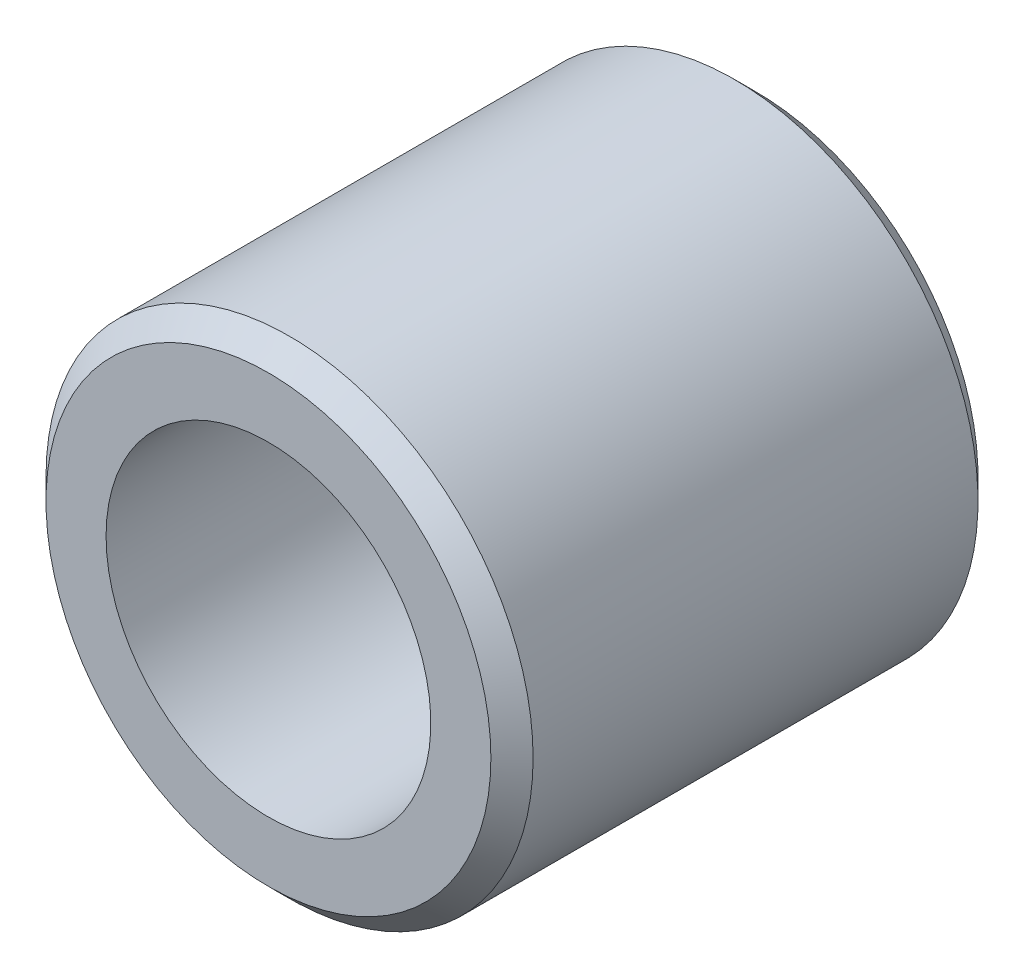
ISO-10303-21;
HEADER;
FILE_DESCRIPTION(('STEP AP214'),'2;1');
FILE_NAME('part.step','',(''),(''),'','','');
FILE_SCHEMA(('AUTOMOTIVE_DESIGN { 1 0 10303 214 1 1 1 1 }'));
ENDSEC;
DATA;
#1=APPLICATION_CONTEXT('core data for automotive mechanical design processes');
#2=APPLICATION_PROTOCOL_DEFINITION('international standard','automotive_design',2000,#1);
#3=PRODUCT_CONTEXT('',#1,'mechanical');
#4=PRODUCT('Part','Part','',(#3));
#5=PRODUCT_RELATED_PRODUCT_CATEGORY('part','',(#4));
#6=PRODUCT_DEFINITION_FORMATION('','',#4);
#7=PRODUCT_DEFINITION_CONTEXT('part definition',#1,'design');
#8=PRODUCT_DEFINITION('design','',#6,#7);
#9=PRODUCT_DEFINITION_SHAPE('','',#8);
#10=(LENGTH_UNIT() NAMED_UNIT(*) SI_UNIT(.MILLI.,.METRE.));
#11=(NAMED_UNIT(*) PLANE_ANGLE_UNIT() SI_UNIT($,.RADIAN.));
#12=(NAMED_UNIT(*) SI_UNIT($,.STERADIAN.) SOLID_ANGLE_UNIT());
#13=UNCERTAINTY_MEASURE_WITH_UNIT(LENGTH_MEASURE(1.E-05),#10,'distance_accuracy_value','');
#14=(GEOMETRIC_REPRESENTATION_CONTEXT(3) GLOBAL_UNCERTAINTY_ASSIGNED_CONTEXT((#13)) GLOBAL_UNIT_ASSIGNED_CONTEXT((#10,
#11,#12)) REPRESENTATION_CONTEXT('',''));
#15=CARTESIAN_POINT('',(0.,0.,0.));
#16=DIRECTION('',(0.,0.,1.));
#17=DIRECTION('',(1.,0.,0.));
#18=AXIS2_PLACEMENT_3D('',#15,#16,#17);
#19=CARTESIAN_POINT('',(0.,0.,0.));
#20=DIRECTION('',(0.,0.,-1.));
#21=DIRECTION('',(-1.,0.,0.));
#22=AXIS2_PLACEMENT_3D('',#19,#20,#21);
#23=CYLINDRICAL_SURFACE('',#22,10.);
#24=CARTESIAN_POINT('',(0.,0.,0.));
#25=DIRECTION('',(0.,0.,-1.));
#26=DIRECTION('',(-1.,0.,0.));
#27=AXIS2_PLACEMENT_3D('',#24,#25,#26);
#28=CIRCLE('',#27,10.);
#29=CARTESIAN_POINT('',(-10.,0.,0.));
#30=VERTEX_POINT('',#29);
#31=EDGE_CURVE('E34',#30,#30,#28,.T.);
#32=ORIENTED_EDGE('',*,*,#31,.T.);
#33=EDGE_LOOP('',(#32));
#34=FACE_BOUND('',#33,.T.);
#35=CARTESIAN_POINT('',(0.,0.,30.));
#36=DIRECTION('',(0.,0.,-1.));
#37=DIRECTION('',(-1.,0.,0.));
#38=AXIS2_PLACEMENT_3D('',#35,#36,#37);
#39=CIRCLE('',#38,10.);
#40=CARTESIAN_POINT('',(-10.,0.,30.));
#41=VERTEX_POINT('',#40);
#42=EDGE_CURVE('E31',#41,#41,#39,.T.);
#43=ORIENTED_EDGE('',*,*,#42,.F.);
#44=EDGE_LOOP('',(#43));
#45=FACE_BOUND('',#44,.T.);
#46=ADVANCED_FACE('F12',(#34,#45),#23,.F.);
#47=CARTESIAN_POINT('',(-10.,0.,30.));
#48=DIRECTION('',(0.,0.,1.));
#49=DIRECTION('',(1.,0.,0.));
#50=AXIS2_PLACEMENT_3D('',#47,#48,#49);
#51=PLANE('',#50);
#52=CARTESIAN_POINT('',(0.,0.,30.));
#53=DIRECTION('',(0.,0.,1.));
#54=DIRECTION('',(1.,0.,0.));
#55=AXIS2_PLACEMENT_3D('',#52,#53,#54);
#56=CIRCLE('',#55,13.7);
#57=CARTESIAN_POINT('',(13.7,0.,30.));
#58=VERTEX_POINT('',#57);
#59=EDGE_CURVE('E8',#58,#58,#56,.T.);
#60=ORIENTED_EDGE('',*,*,#59,.T.);
#61=EDGE_LOOP('',(#60));
#62=FACE_BOUND('',#61,.T.);
#63=ORIENTED_EDGE('',*,*,#42,.T.);
#64=EDGE_LOOP('',(#63));
#65=FACE_BOUND('',#64,.T.);
#66=ADVANCED_FACE('F55',(#62,#65),#51,.T.);
#67=CARTESIAN_POINT('',(0.,0.,0.));
#68=DIRECTION('',(0.,0.,-1.));
#69=DIRECTION('',(-1.,0.,0.));
#70=AXIS2_PLACEMENT_3D('',#67,#68,#69);
#71=CYLINDRICAL_SURFACE('',#70,15.);
#72=CARTESIAN_POINT('',(0.,0.,1.3));
#73=DIRECTION('',(0.,0.,-1.));
#74=DIRECTION('',(-1.,0.,0.));
#75=AXIS2_PLACEMENT_3D('',#72,#73,#74);
#76=CIRCLE('',#75,15.);
#77=CARTESIAN_POINT('',(-15.,0.,1.3));
#78=VERTEX_POINT('',#77);
#79=EDGE_CURVE('E18',#78,#78,#76,.F.);
#80=ORIENTED_EDGE('',*,*,#79,.T.);
#81=EDGE_LOOP('',(#80));
#82=FACE_BOUND('',#81,.T.);
#83=CARTESIAN_POINT('',(0.,0.,28.7));
#84=DIRECTION('',(0.,0.,1.));
#85=DIRECTION('',(1.,0.,0.));
#86=AXIS2_PLACEMENT_3D('',#83,#84,#85);
#87=CIRCLE('',#86,15.);
#88=CARTESIAN_POINT('',(15.,0.,28.7));
#89=VERTEX_POINT('',#88);
#90=EDGE_CURVE('E22',#89,#89,#87,.F.);
#91=ORIENTED_EDGE('',*,*,#90,.T.);
#92=EDGE_LOOP('',(#91));
#93=FACE_BOUND('',#92,.T.);
#94=ADVANCED_FACE('F43',(#82,#93),#71,.T.);
#95=CARTESIAN_POINT('',(-10.,0.,0.));
#96=DIRECTION('',(0.,0.,-1.));
#97=DIRECTION('',(-1.,0.,0.));
#98=AXIS2_PLACEMENT_3D('',#95,#96,#97);
#99=PLANE('',#98);
#100=CARTESIAN_POINT('',(0.,0.,0.));
#101=DIRECTION('',(0.,0.,-1.));
#102=DIRECTION('',(-1.,0.,0.));
#103=AXIS2_PLACEMENT_3D('',#100,#101,#102);
#104=CIRCLE('',#103,13.7);
#105=CARTESIAN_POINT('',(-13.7,0.,0.));
#106=VERTEX_POINT('',#105);
#107=EDGE_CURVE('E26',#106,#106,#104,.T.);
#108=ORIENTED_EDGE('',*,*,#107,.T.);
#109=EDGE_LOOP('',(#108));
#110=FACE_BOUND('',#109,.T.);
#111=ORIENTED_EDGE('',*,*,#31,.F.);
#112=EDGE_LOOP('',(#111));
#113=FACE_BOUND('',#112,.T.);
#114=ADVANCED_FACE('F40',(#110,#113),#99,.T.);
#115=CARTESIAN_POINT('',(0.,0.,0.));
#116=DIRECTION('',(0.,0.,1.));
#117=DIRECTION('',(1.,0.,0.));
#118=AXIS2_PLACEMENT_3D('',#115,#116,#117);
#119=CONICAL_SURFACE('',#118,13.7,0.785398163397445);
#120=ORIENTED_EDGE('',*,*,#79,.F.);
#121=EDGE_LOOP('',(#120));
#122=FACE_BOUND('',#121,.T.);
#123=ORIENTED_EDGE('',*,*,#107,.F.);
#124=EDGE_LOOP('',(#123));
#125=FACE_BOUND('',#124,.T.);
#126=ADVANCED_FACE('F42',(#122,#125),#119,.T.);
#127=CARTESIAN_POINT('',(0.,0.,28.7));
#128=DIRECTION('',(0.,0.,-1.));
#129=DIRECTION('',(-1.,0.,0.));
#130=AXIS2_PLACEMENT_3D('',#127,#128,#129);
#131=CONICAL_SURFACE('',#130,15.,0.78539816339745);
#132=ORIENTED_EDGE('',*,*,#59,.F.);
#133=EDGE_LOOP('',(#132));
#134=FACE_BOUND('',#133,.T.);
#135=ORIENTED_EDGE('',*,*,#90,.F.);
#136=EDGE_LOOP('',(#135));
#137=FACE_BOUND('',#136,.T.);
#138=ADVANCED_FACE('F52',(#134,#137),#131,.T.);
#139=CLOSED_SHELL('',(#46,#66,#94,#114,#126,#138));
#140=MANIFOLD_SOLID_BREP('B1',#139);
#141=ADVANCED_BREP_SHAPE_REPRESENTATION('',(#18,#140),#14);
#142=SHAPE_DEFINITION_REPRESENTATION(#9,#141);
ENDSEC;
END-ISO-10303-21;
